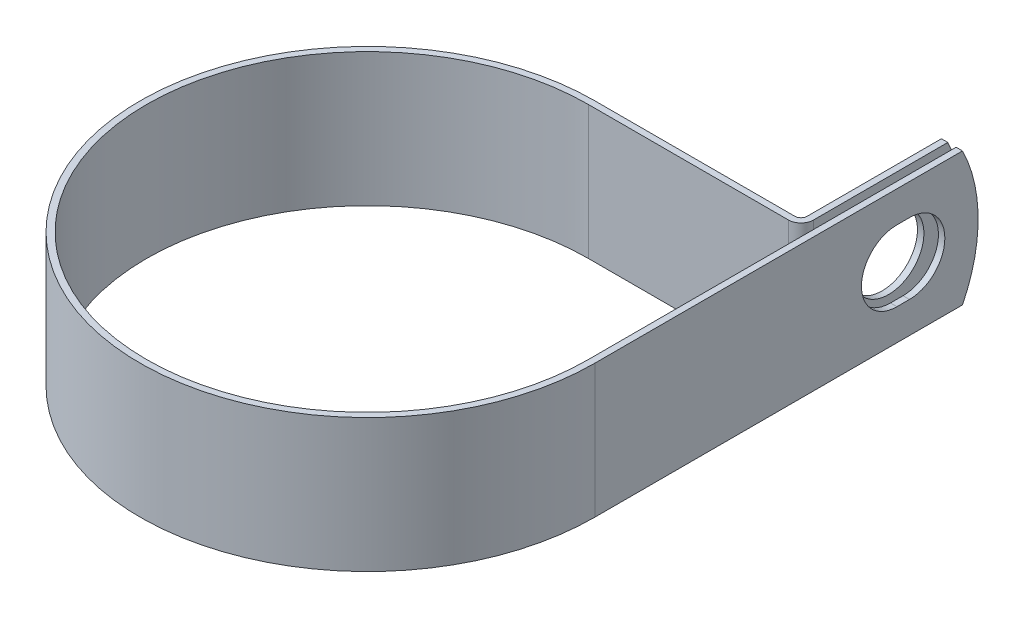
ISO-10303-21;
HEADER;
FILE_DESCRIPTION(('STEP AP214'),'2;1');
FILE_NAME('part.step','',(''),(''),'','','');
FILE_SCHEMA(('AUTOMOTIVE_DESIGN { 1 0 10303 214 1 1 1 1 }'));
ENDSEC;
DATA;
#1=APPLICATION_CONTEXT('core data for automotive mechanical design processes');
#2=APPLICATION_PROTOCOL_DEFINITION('international standard','automotive_design',2000,#1);
#3=PRODUCT_CONTEXT('',#1,'mechanical');
#4=PRODUCT('Part','Part','',(#3));
#5=PRODUCT_RELATED_PRODUCT_CATEGORY('part','',(#4));
#6=PRODUCT_DEFINITION_FORMATION('','',#4);
#7=PRODUCT_DEFINITION_CONTEXT('part definition',#1,'design');
#8=PRODUCT_DEFINITION('design','',#6,#7);
#9=PRODUCT_DEFINITION_SHAPE('','',#8);
#10=(LENGTH_UNIT() NAMED_UNIT(*) SI_UNIT(.MILLI.,.METRE.));
#11=(NAMED_UNIT(*) PLANE_ANGLE_UNIT() SI_UNIT($,.RADIAN.));
#12=(NAMED_UNIT(*) SI_UNIT($,.STERADIAN.) SOLID_ANGLE_UNIT());
#13=UNCERTAINTY_MEASURE_WITH_UNIT(LENGTH_MEASURE(1.E-05),#10,'distance_accuracy_value','');
#14=(GEOMETRIC_REPRESENTATION_CONTEXT(3) GLOBAL_UNCERTAINTY_ASSIGNED_CONTEXT((#13)) GLOBAL_UNIT_ASSIGNED_CONTEXT((#10,
#11,#12)) REPRESENTATION_CONTEXT('',''));
#15=CARTESIAN_POINT('',(0.,0.,0.));
#16=DIRECTION('',(0.,0.,1.));
#17=DIRECTION('',(1.,0.,0.));
#18=AXIS2_PLACEMENT_3D('',#15,#16,#17);
#19=CARTESIAN_POINT('',(42.0624,12.7,0.));
#20=DIRECTION('',(-1.,0.,0.));
#21=DIRECTION('',(0.,0.,1.));
#22=AXIS2_PLACEMENT_3D('',#19,#20,#21);
#23=PLANE('',#22);
#24=DIRECTION('',(0.,0.,-1.));
#25=VECTOR('',#24,1.);
#26=CARTESIAN_POINT('',(42.0624,-6.7437,-57.5309999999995));
#27=LINE('',#26,#25);
#28=CARTESIAN_POINT('',(42.0624,-6.7437,-57.5309999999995));
#29=VERTEX_POINT('',#28);
#30=CARTESIAN_POINT('',(42.0624,-6.7437,-59.9186000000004));
#31=VERTEX_POINT('',#30);
#32=EDGE_CURVE('E236',#29,#31,#27,.T.);
#33=ORIENTED_EDGE('',*,*,#32,.T.);
#34=CARTESIAN_POINT('',(42.0624,0.,-59.9185999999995));
#35=DIRECTION('',(-1.,0.,0.));
#36=DIRECTION('',(0.,0.,1.));
#37=AXIS2_PLACEMENT_3D('',#34,#35,#36);
#38=CIRCLE('',#37,6.7437);
#39=CARTESIAN_POINT('',(42.0624,6.7437,-59.9186000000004));
#40=VERTEX_POINT('',#39);
#41=EDGE_CURVE('E257',#31,#40,#38,.F.);
#42=ORIENTED_EDGE('',*,*,#41,.T.);
#43=DIRECTION('',(0.,0.,1.));
#44=VECTOR('',#43,1.);
#45=CARTESIAN_POINT('',(42.0624,6.7437,-57.5309999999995));
#46=LINE('',#45,#44);
#47=CARTESIAN_POINT('',(42.0624,6.7437,-57.5309999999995));
#48=VERTEX_POINT('',#47);
#49=EDGE_CURVE('E253',#40,#48,#46,.T.);
#50=ORIENTED_EDGE('',*,*,#49,.T.);
#51=CARTESIAN_POINT('',(42.0624,0.,-57.5309999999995));
#52=DIRECTION('',(-1.,0.,0.));
#53=DIRECTION('',(0.,0.,1.));
#54=AXIS2_PLACEMENT_3D('',#51,#52,#53);
#55=CIRCLE('',#54,6.7437);
#56=EDGE_CURVE('E248',#48,#29,#55,.F.);
#57=ORIENTED_EDGE('',*,*,#56,.T.);
#58=EDGE_LOOP('',(#33,#42,#50,#57));
#59=FACE_BOUND('',#58,.T.);
#60=CARTESIAN_POINT('',(42.0624,0.,-44.4246));
#61=DIRECTION('',(-1.,0.,0.));
#62=DIRECTION('',(0.,0.,1.));
#63=AXIS2_PLACEMENT_3D('',#60,#61,#62);
#64=CIRCLE('',#63,28.575);
#65=CARTESIAN_POINT('',(42.0624,12.7,-70.0222683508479));
#66=VERTEX_POINT('',#65);
#67=CARTESIAN_POINT('',(42.0624,-12.7,-70.0222683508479));
#68=VERTEX_POINT('',#67);
#69=EDGE_CURVE('E75',#66,#68,#64,.T.);
#70=ORIENTED_EDGE('',*,*,#69,.T.);
#71=DIRECTION('',(0.,0.,-1.));
#72=VECTOR('',#71,1.);
#73=CARTESIAN_POINT('',(42.0624,-12.7,0.));
#74=LINE('',#73,#72);
#75=CARTESIAN_POINT('',(42.0624,-12.7,0.));
#76=VERTEX_POINT('',#75);
#77=EDGE_CURVE('E271',#76,#68,#74,.T.);
#78=ORIENTED_EDGE('',*,*,#77,.F.);
#79=DIRECTION('',(0.,-1.,0.));
#80=VECTOR('',#79,1.);
#81=CARTESIAN_POINT('',(42.0624,12.7,0.));
#82=LINE('',#81,#80);
#83=CARTESIAN_POINT('',(42.0624,12.7,0.));
#84=VERTEX_POINT('',#83);
#85=EDGE_CURVE('E218',#84,#76,#82,.T.);
#86=ORIENTED_EDGE('',*,*,#85,.F.);
#87=DIRECTION('',(0.,0.,-1.));
#88=VECTOR('',#87,1.);
#89=CARTESIAN_POINT('',(42.0624,12.7,-42.0624));
#90=LINE('',#89,#88);
#91=EDGE_CURVE('E273',#84,#66,#90,.T.);
#92=ORIENTED_EDGE('',*,*,#91,.T.);
#93=EDGE_LOOP('',(#70,#78,#86,#92));
#94=FACE_BOUND('',#93,.T.);
#95=ADVANCED_FACE('F54',(#59,#94),#23,.T.);
#96=CARTESIAN_POINT('',(40.4876,12.7,-72.9996));
#97=DIRECTION('',(1.,0.,0.));
#98=DIRECTION('',(0.,0.,-1.));
#99=AXIS2_PLACEMENT_3D('',#96,#97,#98);
#100=PLANE('',#99);
#101=CARTESIAN_POINT('',(40.4876,0.,-58.7248));
#102=DIRECTION('',(1.,0.,0.));
#103=DIRECTION('',(0.,0.,-1.));
#104=AXIS2_PLACEMENT_3D('',#101,#102,#103);
#105=CIRCLE('',#104,6.7437);
#106=CARTESIAN_POINT('',(40.4876,0.,-51.9811));
#107=VERTEX_POINT('',#106);
#108=EDGE_CURVE('E268',#107,#107,#105,.F.);
#109=ORIENTED_EDGE('',*,*,#108,.T.);
#110=EDGE_LOOP('',(#109));
#111=FACE_BOUND('',#110,.T.);
#112=DIRECTION('',(0.,0.,1.));
#113=VECTOR('',#112,1.);
#114=CARTESIAN_POINT('',(40.4876,-12.7,-72.9996));
#115=LINE('',#114,#113);
#116=CARTESIAN_POINT('',(40.4876,-12.7,-70.0222683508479));
#117=VERTEX_POINT('',#116);
#118=CARTESIAN_POINT('',(40.4876,-12.7,-44.43984));
#119=VERTEX_POINT('',#118);
#120=EDGE_CURVE('E184',#117,#119,#115,.T.);
#121=ORIENTED_EDGE('',*,*,#120,.F.);
#122=CARTESIAN_POINT('',(40.4876,0.,-44.4246));
#123=DIRECTION('',(1.,0.,0.));
#124=DIRECTION('',(0.,0.,-1.));
#125=AXIS2_PLACEMENT_3D('',#122,#123,#124);
#126=CIRCLE('',#125,28.575);
#127=CARTESIAN_POINT('',(40.4876,12.7,-70.0222683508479));
#128=VERTEX_POINT('',#127);
#129=EDGE_CURVE('E176',#117,#128,#126,.T.);
#130=ORIENTED_EDGE('',*,*,#129,.T.);
#131=DIRECTION('',(0.,0.,1.));
#132=VECTOR('',#131,1.);
#133=CARTESIAN_POINT('',(40.4876,12.7,-72.9996));
#134=LINE('',#133,#132);
#135=CARTESIAN_POINT('',(40.4876,12.7,-44.43984));
#136=VERTEX_POINT('',#135);
#137=EDGE_CURVE('E224',#128,#136,#134,.T.);
#138=ORIENTED_EDGE('',*,*,#137,.T.);
#139=DIRECTION('',(0.,-1.,0.));
#140=VECTOR('',#139,1.);
#141=CARTESIAN_POINT('',(40.4876,12.7,-44.43984));
#142=LINE('',#141,#140);
#143=EDGE_CURVE('E211',#136,#119,#142,.T.);
#144=ORIENTED_EDGE('',*,*,#143,.T.);
#145=EDGE_LOOP('',(#121,#130,#138,#144));
#146=FACE_BOUND('',#145,.T.);
#147=ADVANCED_FACE('F226',(#111,#146),#100,.T.);
#148=CARTESIAN_POINT('',(39.2684,12.7,-72.9996));
#149=DIRECTION('',(1.,0.,0.));
#150=DIRECTION('',(0.,0.,-1.));
#151=AXIS2_PLACEMENT_3D('',#148,#149,#150);
#152=PLANE('',#151);
#153=CARTESIAN_POINT('',(39.2684,0.,-58.7248));
#154=DIRECTION('',(-1.,0.,0.));
#155=DIRECTION('',(0.,0.,1.));
#156=AXIS2_PLACEMENT_3D('',#153,#154,#155);
#157=CIRCLE('',#156,6.7437);
#158=CARTESIAN_POINT('',(39.2684,0.,-51.9811));
#159=VERTEX_POINT('',#158);
#160=EDGE_CURVE('E265',#159,#159,#157,.T.);
#161=ORIENTED_EDGE('',*,*,#160,.F.);
#162=EDGE_LOOP('',(#161));
#163=FACE_BOUND('',#162,.T.);
#164=CARTESIAN_POINT('',(39.2684,0.,-44.4246));
#165=DIRECTION('',(-1.,0.,0.));
#166=DIRECTION('',(0.,0.,1.));
#167=AXIS2_PLACEMENT_3D('',#164,#165,#166);
#168=CIRCLE('',#167,28.575);
#169=CARTESIAN_POINT('',(39.2684,12.7,-70.0222683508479));
#170=VERTEX_POINT('',#169);
#171=CARTESIAN_POINT('',(39.2684,-12.7,-70.0222683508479));
#172=VERTEX_POINT('',#171);
#173=EDGE_CURVE('E67',#170,#172,#168,.T.);
#174=ORIENTED_EDGE('',*,*,#173,.T.);
#175=DIRECTION('',(0.,0.,1.));
#176=VECTOR('',#175,1.);
#177=CARTESIAN_POINT('',(39.2684,-12.7,-72.9996));
#178=LINE('',#177,#176);
#179=CARTESIAN_POINT('',(39.2684,-12.7,-44.43984));
#180=VERTEX_POINT('',#179);
#181=EDGE_CURVE('E167',#172,#180,#178,.T.);
#182=ORIENTED_EDGE('',*,*,#181,.T.);
#183=DIRECTION('',(0.,-1.,0.));
#184=VECTOR('',#183,1.);
#185=CARTESIAN_POINT('',(39.2684,12.7,-44.43984));
#186=LINE('',#185,#184);
#187=CARTESIAN_POINT('',(39.2684,12.7,-44.43984));
#188=VERTEX_POINT('',#187);
#189=EDGE_CURVE('E209',#188,#180,#186,.T.);
#190=ORIENTED_EDGE('',*,*,#189,.F.);
#191=DIRECTION('',(0.,0.,1.));
#192=VECTOR('',#191,1.);
#193=CARTESIAN_POINT('',(39.2684,12.7,-72.9996));
#194=LINE('',#193,#192);
#195=EDGE_CURVE('E169',#170,#188,#194,.T.);
#196=ORIENTED_EDGE('',*,*,#195,.F.);
#197=EDGE_LOOP('',(#174,#182,#190,#196));
#198=FACE_BOUND('',#197,.T.);
#199=ADVANCED_FACE('F164',(#163,#198),#152,.F.);
#200=CARTESIAN_POINT('',(43.2816,12.7,0.));
#201=DIRECTION('',(-1.,0.,0.));
#202=DIRECTION('',(0.,0.,1.));
#203=AXIS2_PLACEMENT_3D('',#200,#201,#202);
#204=PLANE('',#203);
#205=CARTESIAN_POINT('',(43.2816,0.,-59.9185999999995));
#206=DIRECTION('',(1.,0.,0.));
#207=DIRECTION('',(0.,0.,-1.));
#208=AXIS2_PLACEMENT_3D('',#205,#206,#207);
#209=CIRCLE('',#208,6.7437);
#210=CARTESIAN_POINT('',(43.2816,-6.7437,-59.9186000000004));
#211=VERTEX_POINT('',#210);
#212=CARTESIAN_POINT('',(43.2816,6.7437,-59.9186000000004));
#213=VERTEX_POINT('',#212);
#214=EDGE_CURVE('E237',#211,#213,#209,.T.);
#215=ORIENTED_EDGE('',*,*,#214,.F.);
#216=DIRECTION('',(0.,0.,-1.));
#217=VECTOR('',#216,1.);
#218=CARTESIAN_POINT('',(43.2816,-6.7437,-57.5309999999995));
#219=LINE('',#218,#217);
#220=CARTESIAN_POINT('',(43.2816,-6.7437,-57.5309999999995));
#221=VERTEX_POINT('',#220);
#222=EDGE_CURVE('E240',#221,#211,#219,.T.);
#223=ORIENTED_EDGE('',*,*,#222,.F.);
#224=CARTESIAN_POINT('',(43.2816,0.,-57.5309999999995));
#225=DIRECTION('',(1.,0.,0.));
#226=DIRECTION('',(0.,0.,-1.));
#227=AXIS2_PLACEMENT_3D('',#224,#225,#226);
#228=CIRCLE('',#227,6.7437);
#229=CARTESIAN_POINT('',(43.2816,6.7437,-57.5309999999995));
#230=VERTEX_POINT('',#229);
#231=EDGE_CURVE('E230',#230,#221,#228,.T.);
#232=ORIENTED_EDGE('',*,*,#231,.F.);
#233=DIRECTION('',(0.,0.,1.));
#234=VECTOR('',#233,1.);
#235=CARTESIAN_POINT('',(43.2816,6.7437,-57.5309999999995));
#236=LINE('',#235,#234);
#237=EDGE_CURVE('E234',#213,#230,#236,.T.);
#238=ORIENTED_EDGE('',*,*,#237,.F.);
#239=EDGE_LOOP('',(#215,#223,#232,#238));
#240=FACE_BOUND('',#239,.T.);
#241=DIRECTION('',(0.,0.,-1.));
#242=VECTOR('',#241,1.);
#243=CARTESIAN_POINT('',(43.2816,-12.7,0.));
#244=LINE('',#243,#242);
#245=CARTESIAN_POINT('',(43.2816,-12.7,0.));
#246=VERTEX_POINT('',#245);
#247=CARTESIAN_POINT('',(43.2816,-12.7,-70.0222683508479));
#248=VERTEX_POINT('',#247);
#249=EDGE_CURVE('E195',#246,#248,#244,.T.);
#250=ORIENTED_EDGE('',*,*,#249,.T.);
#251=CARTESIAN_POINT('',(43.2816,0.,-44.4246));
#252=DIRECTION('',(-1.,0.,0.));
#253=DIRECTION('',(0.,0.,1.));
#254=AXIS2_PLACEMENT_3D('',#251,#252,#253);
#255=CIRCLE('',#254,28.575);
#256=CARTESIAN_POINT('',(43.2816,12.7,-70.0222683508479));
#257=VERTEX_POINT('',#256);
#258=EDGE_CURVE('E170',#257,#248,#255,.T.);
#259=ORIENTED_EDGE('',*,*,#258,.F.);
#260=DIRECTION('',(0.,0.,-1.));
#261=VECTOR('',#260,1.);
#262=CARTESIAN_POINT('',(43.2816,12.7,-42.0624));
#263=LINE('',#262,#261);
#264=CARTESIAN_POINT('',(43.2816,12.7,0.));
#265=VERTEX_POINT('',#264);
#266=EDGE_CURVE('E198',#265,#257,#263,.T.);
#267=ORIENTED_EDGE('',*,*,#266,.F.);
#268=DIRECTION('',(0.,-1.,0.));
#269=VECTOR('',#268,1.);
#270=CARTESIAN_POINT('',(43.2816,12.7,0.));
#271=LINE('',#270,#269);
#272=EDGE_CURVE('E199',#265,#246,#271,.T.);
#273=ORIENTED_EDGE('',*,*,#272,.T.);
#274=EDGE_LOOP('',(#250,#259,#267,#273));
#275=FACE_BOUND('',#274,.T.);
#276=ADVANCED_FACE('F321',(#240,#275),#204,.F.);
#277=CARTESIAN_POINT('',(0.,-12.7,0.));
#278=DIRECTION('',(0.,1.,0.));
#279=DIRECTION('',(1.,0.,0.));
#280=AXIS2_PLACEMENT_3D('',#277,#278,#279);
#281=PLANE('',#280);
#282=DIRECTION('',(-1.,0.,0.));
#283=VECTOR('',#282,1.);
#284=CARTESIAN_POINT('',(43.2816,-12.7,-70.0222683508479));
#285=LINE('',#284,#283);
#286=EDGE_CURVE('E171',#248,#68,#285,.T.);
#287=ORIENTED_EDGE('',*,*,#286,.F.);
#288=ORIENTED_EDGE('',*,*,#249,.F.);
#289=CARTESIAN_POINT('',(0.,-12.7,0.));
#290=DIRECTION('',(0.,1.,0.));
#291=DIRECTION('',(1.,0.,0.));
#292=AXIS2_PLACEMENT_3D('',#289,#290,#291);
#293=CIRCLE('',#292,43.2816);
#294=CARTESIAN_POINT('',(0.,-12.7,-43.2816));
#295=VERTEX_POINT('',#294);
#296=EDGE_CURVE('E193',#295,#246,#293,.T.);
#297=ORIENTED_EDGE('',*,*,#296,.F.);
#298=DIRECTION('',(1.,0.,0.));
#299=VECTOR('',#298,1.);
#300=CARTESIAN_POINT('',(0.,-12.7,-43.2816));
#301=LINE('',#300,#299);
#302=CARTESIAN_POINT('',(38.11016,-12.7,-43.2816));
#303=VERTEX_POINT('',#302);
#304=EDGE_CURVE('E186',#303,#295,#301,.F.);
#305=ORIENTED_EDGE('',*,*,#304,.F.);
#306=CARTESIAN_POINT('',(38.11016,-12.7,-44.43984));
#307=DIRECTION('',(0.,1.,0.));
#308=DIRECTION('',(1.,0.,0.));
#309=AXIS2_PLACEMENT_3D('',#306,#307,#308);
#310=CIRCLE('',#309,1.15824);
#311=EDGE_CURVE('E183',#180,#303,#310,.F.);
#312=ORIENTED_EDGE('',*,*,#311,.F.);
#313=ORIENTED_EDGE('',*,*,#181,.F.);
#314=DIRECTION('',(-1.,0.,0.));
#315=VECTOR('',#314,1.);
#316=CARTESIAN_POINT('',(43.2816,-12.7,-70.0222683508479));
#317=LINE('',#316,#315);
#318=EDGE_CURVE('E12',#117,#172,#317,.T.);
#319=ORIENTED_EDGE('',*,*,#318,.F.);
#320=ORIENTED_EDGE('',*,*,#120,.T.);
#321=CARTESIAN_POINT('',(38.11016,-12.7,-44.43984));
#322=DIRECTION('',(0.,-1.,0.));
#323=DIRECTION('',(0.,0.,1.));
#324=AXIS2_PLACEMENT_3D('',#321,#322,#323);
#325=CIRCLE('',#324,2.37744);
#326=CARTESIAN_POINT('',(38.11016,-12.7,-42.0624));
#327=VERTEX_POINT('',#326);
#328=EDGE_CURVE('E188',#119,#327,#325,.T.);
#329=ORIENTED_EDGE('',*,*,#328,.T.);
#330=DIRECTION('',(-1.,0.,0.));
#331=VECTOR('',#330,1.);
#332=CARTESIAN_POINT('',(0.,-12.7,-42.0624));
#333=LINE('',#332,#331);
#334=CARTESIAN_POINT('',(0.,-12.7,-42.0624));
#335=VERTEX_POINT('',#334);
#336=EDGE_CURVE('E298',#327,#335,#333,.T.);
#337=ORIENTED_EDGE('',*,*,#336,.T.);
#338=CARTESIAN_POINT('',(0.,-12.7,0.));
#339=DIRECTION('',(0.,1.,0.));
#340=DIRECTION('',(0.,0.,1.));
#341=AXIS2_PLACEMENT_3D('',#338,#339,#340);
#342=CIRCLE('',#341,42.0624);
#343=EDGE_CURVE('E295',#335,#76,#342,.T.);
#344=ORIENTED_EDGE('',*,*,#343,.T.);
#345=ORIENTED_EDGE('',*,*,#77,.T.);
#346=EDGE_LOOP('',(#287,#288,#297,#305,#312,#313,#319,#320,#329,#337,#344,#345));
#347=FACE_BOUND('',#346,.T.);
#348=ADVANCED_FACE('F181',(#347),#281,.F.);
#349=CARTESIAN_POINT('',(0.,12.7,0.));
#350=DIRECTION('',(0.,1.,0.));
#351=DIRECTION('',(1.,0.,0.));
#352=AXIS2_PLACEMENT_3D('',#349,#350,#351);
#353=PLANE('',#352);
#354=ORIENTED_EDGE('',*,*,#266,.T.);
#355=DIRECTION('',(-1.,0.,0.));
#356=VECTOR('',#355,1.);
#357=CARTESIAN_POINT('',(43.2816,12.7,-70.0222683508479));
#358=LINE('',#357,#356);
#359=EDGE_CURVE('E228',#257,#66,#358,.T.);
#360=ORIENTED_EDGE('',*,*,#359,.T.);
#361=ORIENTED_EDGE('',*,*,#91,.F.);
#362=CARTESIAN_POINT('',(0.,12.7,0.));
#363=DIRECTION('',(0.,1.,0.));
#364=DIRECTION('',(0.,0.,1.));
#365=AXIS2_PLACEMENT_3D('',#362,#363,#364);
#366=CIRCLE('',#365,42.0624);
#367=CARTESIAN_POINT('',(0.,12.7,-42.0624));
#368=VERTEX_POINT('',#367);
#369=EDGE_CURVE('E276',#368,#84,#366,.T.);
#370=ORIENTED_EDGE('',*,*,#369,.F.);
#371=DIRECTION('',(-1.,0.,0.));
#372=VECTOR('',#371,1.);
#373=CARTESIAN_POINT('',(0.,12.7,-42.0624));
#374=LINE('',#373,#372);
#375=CARTESIAN_POINT('',(38.11016,12.7,-42.0624));
#376=VERTEX_POINT('',#375);
#377=EDGE_CURVE('E279',#376,#368,#374,.T.);
#378=ORIENTED_EDGE('',*,*,#377,.F.);
#379=CARTESIAN_POINT('',(38.11016,12.7,-44.43984));
#380=DIRECTION('',(0.,-1.,0.));
#381=DIRECTION('',(0.,0.,1.));
#382=AXIS2_PLACEMENT_3D('',#379,#380,#381);
#383=CIRCLE('',#382,2.37744);
#384=EDGE_CURVE('E282',#136,#376,#383,.T.);
#385=ORIENTED_EDGE('',*,*,#384,.F.);
#386=ORIENTED_EDGE('',*,*,#137,.F.);
#387=DIRECTION('',(-1.,0.,0.));
#388=VECTOR('',#387,1.);
#389=CARTESIAN_POINT('',(43.2816,12.7,-70.0222683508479));
#390=LINE('',#389,#388);
#391=EDGE_CURVE('E61',#128,#170,#390,.T.);
#392=ORIENTED_EDGE('',*,*,#391,.T.);
#393=ORIENTED_EDGE('',*,*,#195,.T.);
#394=CARTESIAN_POINT('',(38.11016,12.7,-44.43984));
#395=DIRECTION('',(0.,1.,0.));
#396=DIRECTION('',(1.,0.,0.));
#397=AXIS2_PLACEMENT_3D('',#394,#395,#396);
#398=CIRCLE('',#397,1.15824);
#399=CARTESIAN_POINT('',(38.11016,12.7,-43.2816));
#400=VERTEX_POINT('',#399);
#401=EDGE_CURVE('E287',#188,#400,#398,.F.);
#402=ORIENTED_EDGE('',*,*,#401,.T.);
#403=DIRECTION('',(1.,0.,0.));
#404=VECTOR('',#403,1.);
#405=CARTESIAN_POINT('',(0.,12.7,-43.2816));
#406=LINE('',#405,#404);
#407=CARTESIAN_POINT('',(0.,12.7,-43.2816));
#408=VERTEX_POINT('',#407);
#409=EDGE_CURVE('E289',#400,#408,#406,.F.);
#410=ORIENTED_EDGE('',*,*,#409,.T.);
#411=CARTESIAN_POINT('',(0.,12.7,0.));
#412=DIRECTION('',(0.,1.,0.));
#413=DIRECTION('',(1.,0.,0.));
#414=AXIS2_PLACEMENT_3D('',#411,#412,#413);
#415=CIRCLE('',#414,43.2816);
#416=EDGE_CURVE('E203',#408,#265,#415,.T.);
#417=ORIENTED_EDGE('',*,*,#416,.T.);
#418=EDGE_LOOP('',(#354,#360,#361,#370,#378,#385,#386,#392,#393,#402,#410,#417));
#419=FACE_BOUND('',#418,.T.);
#420=ADVANCED_FACE('F222',(#419),#353,.T.);
#421=CARTESIAN_POINT('',(0.,12.7,0.));
#422=DIRECTION('',(0.,-1.,0.));
#423=DIRECTION('',(0.,0.,-1.));
#424=AXIS2_PLACEMENT_3D('',#421,#422,#423);
#425=CYLINDRICAL_SURFACE('',#424,42.0624);
#426=ORIENTED_EDGE('',*,*,#343,.F.);
#427=DIRECTION('',(0.,-1.,0.));
#428=VECTOR('',#427,1.);
#429=CARTESIAN_POINT('',(0.,12.7,-42.0624));
#430=LINE('',#429,#428);
#431=EDGE_CURVE('E216',#368,#335,#430,.T.);
#432=ORIENTED_EDGE('',*,*,#431,.F.);
#433=ORIENTED_EDGE('',*,*,#369,.T.);
#434=ORIENTED_EDGE('',*,*,#85,.T.);
#435=EDGE_LOOP('',(#426,#432,#433,#434));
#436=FACE_BOUND('',#435,.T.);
#437=ADVANCED_FACE('F311',(#436),#425,.F.);
#438=CARTESIAN_POINT('',(0.,12.7,-42.0624));
#439=DIRECTION('',(0.,0.,1.));
#440=DIRECTION('',(1.,0.,0.));
#441=AXIS2_PLACEMENT_3D('',#438,#439,#440);
#442=PLANE('',#441);
#443=ORIENTED_EDGE('',*,*,#336,.F.);
#444=DIRECTION('',(0.,-1.,0.));
#445=VECTOR('',#444,1.);
#446=CARTESIAN_POINT('',(38.11016,12.7,-42.0624));
#447=LINE('',#446,#445);
#448=EDGE_CURVE('E214',#376,#327,#447,.T.);
#449=ORIENTED_EDGE('',*,*,#448,.F.);
#450=ORIENTED_EDGE('',*,*,#377,.T.);
#451=ORIENTED_EDGE('',*,*,#431,.T.);
#452=EDGE_LOOP('',(#443,#449,#450,#451));
#453=FACE_BOUND('',#452,.T.);
#454=ADVANCED_FACE('F307',(#453),#442,.T.);
#455=CARTESIAN_POINT('',(38.11016,12.7,-44.43984));
#456=DIRECTION('',(0.,-1.,0.));
#457=DIRECTION('',(0.,0.,-1.));
#458=AXIS2_PLACEMENT_3D('',#455,#456,#457);
#459=CYLINDRICAL_SURFACE('',#458,2.37744);
#460=ORIENTED_EDGE('',*,*,#328,.F.);
#461=ORIENTED_EDGE('',*,*,#143,.F.);
#462=ORIENTED_EDGE('',*,*,#384,.T.);
#463=ORIENTED_EDGE('',*,*,#448,.T.);
#464=EDGE_LOOP('',(#460,#461,#462,#463));
#465=FACE_BOUND('',#464,.T.);
#466=ADVANCED_FACE('F304',(#465),#459,.T.);
#467=CARTESIAN_POINT('',(38.11016,12.7,-44.43984));
#468=DIRECTION('',(0.,-1.,0.));
#469=DIRECTION('',(0.,0.,-1.));
#470=AXIS2_PLACEMENT_3D('',#467,#468,#469);
#471=CYLINDRICAL_SURFACE('',#470,1.15824);
#472=ORIENTED_EDGE('',*,*,#311,.T.);
#473=DIRECTION('',(0.,-1.,0.));
#474=VECTOR('',#473,1.);
#475=CARTESIAN_POINT('',(38.11016,12.7,-43.2816));
#476=LINE('',#475,#474);
#477=EDGE_CURVE('E206',#400,#303,#476,.T.);
#478=ORIENTED_EDGE('',*,*,#477,.F.);
#479=ORIENTED_EDGE('',*,*,#401,.F.);
#480=ORIENTED_EDGE('',*,*,#189,.T.);
#481=EDGE_LOOP('',(#472,#478,#479,#480));
#482=FACE_BOUND('',#481,.T.);
#483=ADVANCED_FACE('F334',(#482),#471,.F.);
#484=CARTESIAN_POINT('',(0.,12.7,-43.2816));
#485=DIRECTION('',(0.,0.,1.));
#486=DIRECTION('',(1.,0.,0.));
#487=AXIS2_PLACEMENT_3D('',#484,#485,#486);
#488=PLANE('',#487);
#489=ORIENTED_EDGE('',*,*,#304,.T.);
#490=DIRECTION('',(0.,-1.,0.));
#491=VECTOR('',#490,1.);
#492=CARTESIAN_POINT('',(0.,12.7,-43.2816));
#493=LINE('',#492,#491);
#494=EDGE_CURVE('E202',#408,#295,#493,.T.);
#495=ORIENTED_EDGE('',*,*,#494,.F.);
#496=ORIENTED_EDGE('',*,*,#409,.F.);
#497=ORIENTED_EDGE('',*,*,#477,.T.);
#498=EDGE_LOOP('',(#489,#495,#496,#497));
#499=FACE_BOUND('',#498,.T.);
#500=ADVANCED_FACE('F330',(#499),#488,.F.);
#501=CARTESIAN_POINT('',(0.,12.7,0.));
#502=DIRECTION('',(0.,-1.,0.));
#503=DIRECTION('',(0.,0.,-1.));
#504=AXIS2_PLACEMENT_3D('',#501,#502,#503);
#505=CYLINDRICAL_SURFACE('',#504,43.2816);
#506=ORIENTED_EDGE('',*,*,#296,.T.);
#507=ORIENTED_EDGE('',*,*,#272,.F.);
#508=ORIENTED_EDGE('',*,*,#416,.F.);
#509=ORIENTED_EDGE('',*,*,#494,.T.);
#510=EDGE_LOOP('',(#506,#507,#508,#509));
#511=FACE_BOUND('',#510,.T.);
#512=ADVANCED_FACE('F327',(#511),#505,.T.);
#513=CARTESIAN_POINT('',(59.5616640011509,0.,-58.7248));
#514=DIRECTION('',(-1.,0.,0.));
#515=DIRECTION('',(0.,0.,1.));
#516=AXIS2_PLACEMENT_3D('',#513,#514,#515);
#517=CYLINDRICAL_SURFACE('',#516,6.7437);
#518=CARTESIAN_POINT('',(39.2684,0.,-51.9811));
#519=CARTESIAN_POINT('',(39.2811,0.,-51.9811));
#520=CARTESIAN_POINT('',(39.2938,0.,-51.9811));
#521=CARTESIAN_POINT('',(39.3192,0.,-51.9811));
#522=CARTESIAN_POINT('',(39.3319,0.,-51.9811));
#523=CARTESIAN_POINT('',(39.3573,0.,-51.9811));
#524=CARTESIAN_POINT('',(39.37,0.,-51.9811));
#525=CARTESIAN_POINT('',(39.3954,0.,-51.9811));
#526=CARTESIAN_POINT('',(39.4081,0.,-51.9811));
#527=CARTESIAN_POINT('',(39.4335,0.,-51.9811));
#528=CARTESIAN_POINT('',(39.4462,0.,-51.9811));
#529=CARTESIAN_POINT('',(39.4716,0.,-51.9811));
#530=CARTESIAN_POINT('',(39.4843,0.,-51.9811));
#531=CARTESIAN_POINT('',(39.5097,0.,-51.9811));
#532=CARTESIAN_POINT('',(39.5224,0.,-51.9811));
#533=CARTESIAN_POINT('',(39.5478,0.,-51.9811));
#534=CARTESIAN_POINT('',(39.5605,0.,-51.9811));
#535=CARTESIAN_POINT('',(39.5859,0.,-51.9811));
#536=CARTESIAN_POINT('',(39.5986,0.,-51.9811));
#537=CARTESIAN_POINT('',(39.624,0.,-51.9811));
#538=CARTESIAN_POINT('',(39.6367,0.,-51.9811));
#539=CARTESIAN_POINT('',(39.6621,0.,-51.9811));
#540=CARTESIAN_POINT('',(39.6748,0.,-51.9811));
#541=CARTESIAN_POINT('',(39.7002,0.,-51.9811));
#542=CARTESIAN_POINT('',(39.7129,0.,-51.9811));
#543=CARTESIAN_POINT('',(39.7383,0.,-51.9811));
#544=CARTESIAN_POINT('',(39.751,0.,-51.9811));
#545=CARTESIAN_POINT('',(39.7764,0.,-51.9811));
#546=CARTESIAN_POINT('',(39.7891,0.,-51.9811));
#547=CARTESIAN_POINT('',(39.8145,0.,-51.9811));
#548=CARTESIAN_POINT('',(39.8272,0.,-51.9811));
#549=CARTESIAN_POINT('',(39.8526,0.,-51.9811));
#550=CARTESIAN_POINT('',(39.8653,0.,-51.9811));
#551=CARTESIAN_POINT('',(39.8907,0.,-51.9811));
#552=CARTESIAN_POINT('',(39.9034,0.,-51.9811));
#553=CARTESIAN_POINT('',(39.9288,0.,-51.9811));
#554=CARTESIAN_POINT('',(39.9415,0.,-51.9811));
#555=CARTESIAN_POINT('',(39.9669,0.,-51.9811));
#556=CARTESIAN_POINT('',(39.9796,0.,-51.9811));
#557=CARTESIAN_POINT('',(40.005,0.,-51.9811));
#558=CARTESIAN_POINT('',(40.0177,0.,-51.9811));
#559=CARTESIAN_POINT('',(40.0431,0.,-51.9811));
#560=CARTESIAN_POINT('',(40.0558,0.,-51.9811));
#561=CARTESIAN_POINT('',(40.0812,0.,-51.9811));
#562=CARTESIAN_POINT('',(40.0939,0.,-51.9811));
#563=CARTESIAN_POINT('',(40.1193,0.,-51.9811));
#564=CARTESIAN_POINT('',(40.132,0.,-51.9811));
#565=CARTESIAN_POINT('',(40.1574,0.,-51.9811));
#566=CARTESIAN_POINT('',(40.1701,0.,-51.9811));
#567=CARTESIAN_POINT('',(40.1955,0.,-51.9811));
#568=CARTESIAN_POINT('',(40.2082,0.,-51.9811));
#569=CARTESIAN_POINT('',(40.2336,0.,-51.9811));
#570=CARTESIAN_POINT('',(40.2463,0.,-51.9811));
#571=CARTESIAN_POINT('',(40.2717,0.,-51.9811));
#572=CARTESIAN_POINT('',(40.2844,0.,-51.9811));
#573=CARTESIAN_POINT('',(40.3098,0.,-51.9811));
#574=CARTESIAN_POINT('',(40.3225,0.,-51.9811));
#575=CARTESIAN_POINT('',(40.3479,0.,-51.9811));
#576=CARTESIAN_POINT('',(40.3606,0.,-51.9811));
#577=CARTESIAN_POINT('',(40.386,0.,-51.9811));
#578=CARTESIAN_POINT('',(40.3987,0.,-51.9811));
#579=CARTESIAN_POINT('',(40.4241,0.,-51.9811));
#580=CARTESIAN_POINT('',(40.4368,0.,-51.9811));
#581=CARTESIAN_POINT('',(40.4622,0.,-51.9811));
#582=CARTESIAN_POINT('',(40.4749,0.,-51.9811));
#583=CARTESIAN_POINT('',(40.4876,0.,-51.9811));
#584=B_SPLINE_CURVE_WITH_KNOTS('',3,(#518,#519,#520,#521,#522,#523,#524,#525,#526,#527,#528,
#529,#530,#531,#532,#533,#534,#535,#536,#537,#538,#539,#540,#541,#542,#543,#544,#545,#546,#547,
#548,#549,#550,#551,#552,#553,#554,#555,#556,#557,#558,#559,#560,#561,#562,#563,#564,#565,#566,
#567,#568,#569,#570,#571,#572,#573,#574,#575,#576,#577,#578,#579,#580,#581,#582,#583),
.UNSPECIFIED.,.F.,.F.,(4,2,2,2,2,2,2,2,2,2,2,2,2,2,2,2,2,2,2,2,2,2,2,2,2,2,2,2,2,2,2,2,4),(0.,
0.0380999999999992,0.0762000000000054,0.114300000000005,0.152400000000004,0.19050000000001,
0.228600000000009,0.266700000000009,0.304800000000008,0.342900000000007,0.381000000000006,
0.419100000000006,0.457200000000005,0.495300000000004,0.533400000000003,0.571500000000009,
0.609600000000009,0.647700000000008,0.685800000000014,0.723900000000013,0.762000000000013,
0.800100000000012,0.838200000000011,0.87630000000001,0.91440000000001,0.952500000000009,
0.990600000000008,1.02870000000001,1.06680000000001,1.10490000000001,1.14300000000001,
1.18110000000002,1.21920000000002),.UNSPECIFIED.);
#585=EDGE_CURVE('BSEAM379',#159,#107,#584,.T.);
#586=ORIENTED_EDGE('',*,*,#160,.T.);
#587=ORIENTED_EDGE('',*,*,#108,.F.);
#588=ORIENTED_EDGE('',*,*,#585,.T.);
#589=ORIENTED_EDGE('',*,*,#585,.F.);
#590=EDGE_LOOP('',(#586,#588,#587,#589));
#591=FACE_BOUND('',#590,.T.);
#592=ADVANCED_FACE('F379',(#591),#517,.F.);
#593=CARTESIAN_POINT('',(21.2315194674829,-6.7437,-57.5309999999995));
#594=DIRECTION('',(0.,-1.,0.));
#595=DIRECTION('',(0.,0.,-1.));
#596=AXIS2_PLACEMENT_3D('',#593,#594,#595);
#597=PLANE('',#596);
#598=DIRECTION('',(1.,0.,0.));
#599=VECTOR('',#598,1.);
#600=CARTESIAN_POINT('',(21.2315194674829,-6.7437,-57.5309999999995));
#601=LINE('',#600,#599);
#602=EDGE_CURVE('E251',#29,#221,#601,.T.);
#603=ORIENTED_EDGE('',*,*,#602,.T.);
#604=ORIENTED_EDGE('',*,*,#222,.T.);
#605=DIRECTION('',(1.,0.,0.));
#606=VECTOR('',#605,1.);
#607=CARTESIAN_POINT('',(21.2315194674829,-6.7437,-59.9186000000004));
#608=LINE('',#607,#606);
#609=EDGE_CURVE('E247',#31,#211,#608,.T.);
#610=ORIENTED_EDGE('',*,*,#609,.F.);
#611=ORIENTED_EDGE('',*,*,#32,.F.);
#612=EDGE_LOOP('',(#603,#604,#610,#611));
#613=FACE_BOUND('',#612,.T.);
#614=ADVANCED_FACE('F354',(#613),#597,.F.);
#615=CARTESIAN_POINT('',(21.2315194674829,0.,-59.9185999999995));
#616=DIRECTION('',(1.,0.,0.));
#617=DIRECTION('',(0.,0.,-1.));
#618=AXIS2_PLACEMENT_3D('',#615,#616,#617);
#619=CYLINDRICAL_SURFACE('',#618,6.7437);
#620=ORIENTED_EDGE('',*,*,#609,.T.);
#621=ORIENTED_EDGE('',*,*,#214,.T.);
#622=DIRECTION('',(1.,0.,0.));
#623=VECTOR('',#622,1.);
#624=CARTESIAN_POINT('',(21.2315194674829,6.7437,-59.9186000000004));
#625=LINE('',#624,#623);
#626=EDGE_CURVE('E256',#40,#213,#625,.T.);
#627=ORIENTED_EDGE('',*,*,#626,.F.);
#628=ORIENTED_EDGE('',*,*,#41,.F.);
#629=EDGE_LOOP('',(#620,#621,#627,#628));
#630=FACE_BOUND('',#629,.T.);
#631=ADVANCED_FACE('F358',(#630),#619,.F.);
#632=CARTESIAN_POINT('',(21.2315194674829,6.7437,-57.5309999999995));
#633=DIRECTION('',(0.,1.,0.));
#634=DIRECTION('',(0.,0.,1.));
#635=AXIS2_PLACEMENT_3D('',#632,#633,#634);
#636=PLANE('',#635);
#637=ORIENTED_EDGE('',*,*,#626,.T.);
#638=ORIENTED_EDGE('',*,*,#237,.T.);
#639=DIRECTION('',(1.,0.,0.));
#640=VECTOR('',#639,1.);
#641=CARTESIAN_POINT('',(21.2315194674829,6.7437,-57.5309999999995));
#642=LINE('',#641,#640);
#643=EDGE_CURVE('E252',#48,#230,#642,.T.);
#644=ORIENTED_EDGE('',*,*,#643,.F.);
#645=ORIENTED_EDGE('',*,*,#49,.F.);
#646=EDGE_LOOP('',(#637,#638,#644,#645));
#647=FACE_BOUND('',#646,.T.);
#648=ADVANCED_FACE('F362',(#647),#636,.F.);
#649=CARTESIAN_POINT('',(21.2315194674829,0.,-57.5309999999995));
#650=DIRECTION('',(1.,0.,0.));
#651=DIRECTION('',(0.,0.,-1.));
#652=AXIS2_PLACEMENT_3D('',#649,#650,#651);
#653=CYLINDRICAL_SURFACE('',#652,6.7437);
#654=ORIENTED_EDGE('',*,*,#643,.T.);
#655=ORIENTED_EDGE('',*,*,#231,.T.);
#656=ORIENTED_EDGE('',*,*,#602,.F.);
#657=ORIENTED_EDGE('',*,*,#56,.F.);
#658=EDGE_LOOP('',(#654,#655,#656,#657));
#659=FACE_BOUND('',#658,.T.);
#660=ADVANCED_FACE('F366',(#659),#653,.F.);
#661=CARTESIAN_POINT('',(43.2816,0.,-44.4246));
#662=DIRECTION('',(-1.,0.,0.));
#663=DIRECTION('',(0.,0.,1.));
#664=AXIS2_PLACEMENT_3D('',#661,#662,#663);
#665=CYLINDRICAL_SURFACE('',#664,28.575);
#666=ORIENTED_EDGE('',*,*,#129,.F.);
#667=ORIENTED_EDGE('',*,*,#318,.T.);
#668=ORIENTED_EDGE('',*,*,#173,.F.);
#669=ORIENTED_EDGE('',*,*,#391,.F.);
#670=EDGE_LOOP('',(#666,#667,#668,#669));
#671=FACE_BOUND('',#670,.T.);
#672=ADVANCED_FACE('F174',(#671),#665,.T.);
#673=ORIENTED_EDGE('',*,*,#359,.F.);
#674=ORIENTED_EDGE('',*,*,#258,.T.);
#675=ORIENTED_EDGE('',*,*,#286,.T.);
#676=ORIENTED_EDGE('',*,*,#69,.F.);
#677=EDGE_LOOP('',(#673,#674,#675,#676));
#678=FACE_BOUND('',#677,.T.);
#679=ADVANCED_FACE('F316',(#678),#665,.T.);
#680=CLOSED_SHELL('',(#95,#147,#199,#276,#348,#420,#437,#454,#466,#483,#500,#512,#592,#614,#631,
#648,#660,#672,#679));
#681=MANIFOLD_SOLID_BREP('B2',#680);
#682=ADVANCED_BREP_SHAPE_REPRESENTATION('',(#18,#681),#14);
#683=SHAPE_DEFINITION_REPRESENTATION(#9,#682);
ENDSEC;
END-ISO-10303-21;
